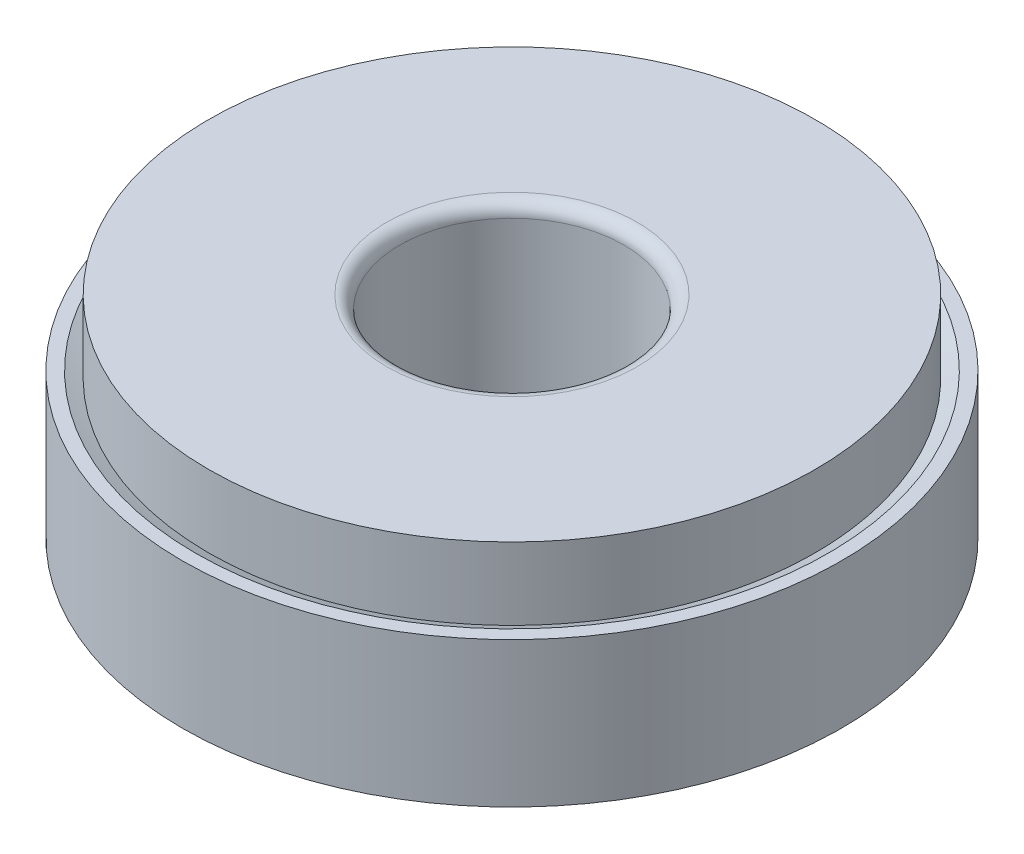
ISO-10303-21;
HEADER;
FILE_DESCRIPTION(('STEP AP214'),'2;1');
FILE_NAME('part.step','',(''),(''),'','','');
FILE_SCHEMA(('AUTOMOTIVE_DESIGN { 1 0 10303 214 1 1 1 1 }'));
ENDSEC;
DATA;
#1=APPLICATION_CONTEXT('core data for automotive mechanical design processes');
#2=APPLICATION_PROTOCOL_DEFINITION('international standard','automotive_design',2000,#1);
#3=PRODUCT_CONTEXT('',#1,'mechanical');
#4=PRODUCT('Part','Part','',(#3));
#5=PRODUCT_RELATED_PRODUCT_CATEGORY('part','',(#4));
#6=PRODUCT_DEFINITION_FORMATION('','',#4);
#7=PRODUCT_DEFINITION_CONTEXT('part definition',#1,'design');
#8=PRODUCT_DEFINITION('design','',#6,#7);
#9=PRODUCT_DEFINITION_SHAPE('','',#8);
#10=(LENGTH_UNIT() NAMED_UNIT(*) SI_UNIT(.MILLI.,.METRE.));
#11=(NAMED_UNIT(*) PLANE_ANGLE_UNIT() SI_UNIT($,.RADIAN.));
#12=(NAMED_UNIT(*) SI_UNIT($,.STERADIAN.) SOLID_ANGLE_UNIT());
#13=UNCERTAINTY_MEASURE_WITH_UNIT(LENGTH_MEASURE(1.E-05),#10,'distance_accuracy_value','');
#14=(GEOMETRIC_REPRESENTATION_CONTEXT(3) GLOBAL_UNCERTAINTY_ASSIGNED_CONTEXT((#13)) GLOBAL_UNIT_ASSIGNED_CONTEXT((#10,
#11,#12)) REPRESENTATION_CONTEXT('',''));
#15=CARTESIAN_POINT('',(0.,0.,0.));
#16=DIRECTION('',(0.,0.,1.));
#17=DIRECTION('',(1.,0.,0.));
#18=AXIS2_PLACEMENT_3D('',#15,#16,#17);
#19=CARTESIAN_POINT('',(0.,8.,0.));
#20=DIRECTION('',(0.,-1.,0.));
#21=DIRECTION('',(0.,0.,-1.));
#22=AXIS2_PLACEMENT_3D('',#19,#20,#21);
#23=CYLINDRICAL_SURFACE('',#22,11.5);
#24=CARTESIAN_POINT('',(0.,5.25424262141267,0.));
#25=DIRECTION('',(0.,1.,0.));
#26=DIRECTION('',(0.,0.,1.));
#27=AXIS2_PLACEMENT_3D('',#24,#25,#26);
#28=CIRCLE('',#27,11.5);
#29=CARTESIAN_POINT('',(0.,5.25424262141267,11.5));
#30=VERTEX_POINT('',#29);
#31=EDGE_CURVE('P0_E29',#30,#30,#28,.T.);
#32=ORIENTED_EDGE('',*,*,#31,.T.);
#33=EDGE_LOOP('',(#32));
#34=FACE_BOUND('',#33,.T.);
#35=CARTESIAN_POINT('',(0.,8.,0.));
#36=DIRECTION('',(0.,1.,0.));
#37=DIRECTION('',(0.,0.,1.));
#38=AXIS2_PLACEMENT_3D('',#35,#36,#37);
#39=CIRCLE('',#38,11.5);
#40=CARTESIAN_POINT('',(0.,8.,11.5));
#41=VERTEX_POINT('',#40);
#42=EDGE_CURVE('P0_E25',#41,#41,#39,.T.);
#43=ORIENTED_EDGE('',*,*,#42,.F.);
#44=EDGE_LOOP('',(#43));
#45=FACE_BOUND('',#44,.T.);
#46=ADVANCED_FACE('P0_F14',(#34,#45),#23,.T.);
#47=CARTESIAN_POINT('',(0.,8.,0.));
#48=DIRECTION('',(0.,1.,0.));
#49=DIRECTION('',(0.,0.,1.));
#50=AXIS2_PLACEMENT_3D('',#47,#48,#49);
#51=PLANE('',#50);
#52=CARTESIAN_POINT('',(0.,8.,0.));
#53=DIRECTION('',(0.,1.,0.));
#54=DIRECTION('',(0.,0.,1.));
#55=AXIS2_PLACEMENT_3D('',#52,#53,#54);
#56=CIRCLE('',#55,4.75);
#57=CARTESIAN_POINT('',(0.,8.,4.75));
#58=VERTEX_POINT('',#57);
#59=EDGE_CURVE('P0_E21',#58,#58,#56,.F.);
#60=ORIENTED_EDGE('',*,*,#59,.T.);
#61=EDGE_LOOP('',(#60));
#62=FACE_BOUND('',#61,.T.);
#63=ORIENTED_EDGE('',*,*,#42,.T.);
#64=EDGE_LOOP('',(#63));
#65=FACE_BOUND('',#64,.T.);
#66=ADVANCED_FACE('P0_F92',(#62,#65),#51,.T.);
#67=CARTESIAN_POINT('',(0.,29.2828124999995,0.));
#68=DIRECTION('',(-1.,0.,0.));
#69=DIRECTION('',(0.,-1.,0.));
#70=AXIS2_PLACEMENT_3D('',#67,#68,#69);
#71=SPHERICAL_SURFACE('',#70,26.6387343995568);
#72=CARTESIAN_POINT('',(0.,29.2828124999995,0.));
#73=DIRECTION('',(0.,1.,0.));
#74=DIRECTION('',(0.,0.,1.));
#75=AXIS2_PLACEMENT_3D('',#72,#73,#74);
#76=SPHERICAL_SURFACE('',#75,26.6387343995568);
#77=CARTESIAN_POINT('',(0.,3.3,0.));
#78=DIRECTION('',(0.,1.,0.));
#79=DIRECTION('',(0.,0.,1.));
#80=AXIS2_PLACEMENT_3D('',#77,#78,#79);
#81=CIRCLE('',#80,5.87499999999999);
#82=CARTESIAN_POINT('',(0.,3.3,5.87499999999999));
#83=VERTEX_POINT('',#82);
#84=EDGE_CURVE('P0_E49',#83,#83,#81,.T.);
#85=ORIENTED_EDGE('',*,*,#84,.T.);
#86=EDGE_LOOP('',(#85));
#87=FACE_BOUND('',#86,.T.);
#88=ORIENTED_EDGE('',*,*,#31,.F.);
#89=EDGE_LOOP('',(#88));
#90=FACE_BOUND('',#89,.T.);
#91=ADVANCED_FACE('P0_F53',(#87,#90),#76,.T.);
#92=CARTESIAN_POINT('',(0.,1.5,0.));
#93=DIRECTION('',(0.,1.,0.));
#94=DIRECTION('',(0.,0.,1.));
#95=AXIS2_PLACEMENT_3D('',#92,#93,#94);
#96=CYLINDRICAL_SURFACE('',#95,5.875);
#97=CARTESIAN_POINT('',(0.,2.4,0.));
#98=DIRECTION('',(0.,1.,0.));
#99=DIRECTION('',(0.,0.,1.));
#100=AXIS2_PLACEMENT_3D('',#97,#98,#99);
#101=CIRCLE('',#100,5.875);
#102=CARTESIAN_POINT('',(0.,2.4,5.875));
#103=VERTEX_POINT('',#102);
#104=EDGE_CURVE('P0_E40',#103,#103,#101,.T.);
#105=CARTESIAN_POINT('',(0.,1.5,0.));
#106=DIRECTION('',(0.,1.,0.));
#107=DIRECTION('',(0.,0.,1.));
#108=AXIS2_PLACEMENT_3D('',#105,#106,#107);
#109=CIRCLE('',#108,5.875);
#110=CARTESIAN_POINT('',(0.,1.5,5.875));
#111=VERTEX_POINT('',#110);
#112=EDGE_CURVE('P0_E33',#111,#111,#109,.T.);
#113=CARTESIAN_POINT('',(0.,2.4,5.875));
#114=CARTESIAN_POINT('',(0.,2.390625,5.875));
#115=CARTESIAN_POINT('',(0.,2.38125,5.875));
#116=CARTESIAN_POINT('',(0.,2.3625,5.875));
#117=CARTESIAN_POINT('',(0.,2.353125,5.875));
#118=CARTESIAN_POINT('',(0.,2.334375,5.875));
#119=CARTESIAN_POINT('',(0.,2.325,5.875));
#120=CARTESIAN_POINT('',(0.,2.30625,5.875));
#121=CARTESIAN_POINT('',(0.,2.296875,5.875));
#122=CARTESIAN_POINT('',(0.,2.278125,5.875));
#123=CARTESIAN_POINT('',(0.,2.26875,5.875));
#124=CARTESIAN_POINT('',(0.,2.25,5.875));
#125=CARTESIAN_POINT('',(0.,2.240625,5.875));
#126=CARTESIAN_POINT('',(0.,2.221875,5.875));
#127=CARTESIAN_POINT('',(0.,2.2125,5.875));
#128=CARTESIAN_POINT('',(0.,2.19375,5.875));
#129=CARTESIAN_POINT('',(0.,2.184375,5.875));
#130=CARTESIAN_POINT('',(0.,2.165625,5.875));
#131=CARTESIAN_POINT('',(0.,2.15625,5.875));
#132=CARTESIAN_POINT('',(0.,2.1375,5.875));
#133=CARTESIAN_POINT('',(0.,2.128125,5.875));
#134=CARTESIAN_POINT('',(0.,2.109375,5.875));
#135=CARTESIAN_POINT('',(0.,2.1,5.875));
#136=CARTESIAN_POINT('',(0.,2.08125,5.875));
#137=CARTESIAN_POINT('',(0.,2.071875,5.875));
#138=CARTESIAN_POINT('',(0.,2.053125,5.875));
#139=CARTESIAN_POINT('',(0.,2.04375,5.875));
#140=CARTESIAN_POINT('',(0.,2.025,5.875));
#141=CARTESIAN_POINT('',(0.,2.015625,5.875));
#142=CARTESIAN_POINT('',(0.,1.996875,5.875));
#143=CARTESIAN_POINT('',(0.,1.9875,5.875));
#144=CARTESIAN_POINT('',(0.,1.96875,5.875));
#145=CARTESIAN_POINT('',(0.,1.959375,5.875));
#146=CARTESIAN_POINT('',(0.,1.940625,5.875));
#147=CARTESIAN_POINT('',(0.,1.93125,5.875));
#148=CARTESIAN_POINT('',(0.,1.9125,5.875));
#149=CARTESIAN_POINT('',(0.,1.903125,5.875));
#150=CARTESIAN_POINT('',(0.,1.884375,5.875));
#151=CARTESIAN_POINT('',(0.,1.875,5.875));
#152=CARTESIAN_POINT('',(0.,1.85625,5.875));
#153=CARTESIAN_POINT('',(0.,1.846875,5.875));
#154=CARTESIAN_POINT('',(0.,1.828125,5.875));
#155=CARTESIAN_POINT('',(0.,1.81875,5.875));
#156=CARTESIAN_POINT('',(0.,1.8,5.875));
#157=CARTESIAN_POINT('',(0.,1.790625,5.875));
#158=CARTESIAN_POINT('',(0.,1.771875,5.875));
#159=CARTESIAN_POINT('',(0.,1.7625,5.875));
#160=CARTESIAN_POINT('',(0.,1.74375,5.875));
#161=CARTESIAN_POINT('',(0.,1.734375,5.875));
#162=CARTESIAN_POINT('',(0.,1.715625,5.875));
#163=CARTESIAN_POINT('',(0.,1.70625,5.875));
#164=CARTESIAN_POINT('',(0.,1.6875,5.875));
#165=CARTESIAN_POINT('',(0.,1.678125,5.875));
#166=CARTESIAN_POINT('',(0.,1.659375,5.875));
#167=CARTESIAN_POINT('',(0.,1.65,5.875));
#168=CARTESIAN_POINT('',(0.,1.63125,5.875));
#169=CARTESIAN_POINT('',(0.,1.621875,5.875));
#170=CARTESIAN_POINT('',(0.,1.603125,5.875));
#171=CARTESIAN_POINT('',(0.,1.59375,5.875));
#172=CARTESIAN_POINT('',(0.,1.575,5.875));
#173=CARTESIAN_POINT('',(0.,1.565625,5.875));
#174=CARTESIAN_POINT('',(0.,1.546875,5.875));
#175=CARTESIAN_POINT('',(0.,1.5375,5.875));
#176=CARTESIAN_POINT('',(0.,1.51875,5.875));
#177=CARTESIAN_POINT('',(0.,1.509375,5.875));
#178=CARTESIAN_POINT('',(0.,1.5,5.875));
#179=B_SPLINE_CURVE_WITH_KNOTS('',3,(#113,#114,#115,#116,#117,#118,#119,#120,#121,#122,#123,
#124,#125,#126,#127,#128,#129,#130,#131,#132,#133,#134,#135,#136,#137,#138,#139,#140,#141,#142,
#143,#144,#145,#146,#147,#148,#149,#150,#151,#152,#153,#154,#155,#156,#157,#158,#159,#160,#161,
#162,#163,#164,#165,#166,#167,#168,#169,#170,#171,#172,#173,#174,#175,#176,#177,#178),
.UNSPECIFIED.,.F.,.F.,(4,2,2,2,2,2,2,2,2,2,2,2,2,2,2,2,2,2,2,2,2,2,2,2,2,2,2,2,2,2,2,2,4),(0.,
0.0281249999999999,0.0562499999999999,0.0843749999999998,0.1125,0.140625,0.16875,0.196875,0.225,
0.253124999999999,0.281249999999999,0.309374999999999,0.337499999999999,0.365624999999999,
0.393749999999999,0.421874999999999,0.449999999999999,0.478124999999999,0.506249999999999,
0.534374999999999,0.562499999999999,0.590624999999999,0.618749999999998,0.646874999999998,
0.674999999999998,0.703124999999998,0.731249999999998,0.759374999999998,0.787499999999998,
0.815624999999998,0.843749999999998,0.871874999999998,0.899999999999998),.UNSPECIFIED.);
#180=EDGE_CURVE('P0_BSEAM75',#103,#111,#179,.T.);
#181=ORIENTED_EDGE('',*,*,#104,.F.);
#182=ORIENTED_EDGE('',*,*,#112,.T.);
#183=ORIENTED_EDGE('',*,*,#180,.T.);
#184=ORIENTED_EDGE('',*,*,#180,.F.);
#185=EDGE_LOOP('',(#181,#183,#182,#184));
#186=FACE_BOUND('',#185,.T.);
#187=ADVANCED_FACE('P0_F75',(#186),#96,.T.);
#188=CARTESIAN_POINT('',(0.,1.5,0.));
#189=DIRECTION('',(0.,1.,0.));
#190=DIRECTION('',(0.,0.,1.));
#191=AXIS2_PLACEMENT_3D('',#188,#189,#190);
#192=PLANE('',#191);
#193=CARTESIAN_POINT('',(0.,1.5,0.));
#194=DIRECTION('',(0.,-1.,0.));
#195=DIRECTION('',(0.,0.,-1.));
#196=AXIS2_PLACEMENT_3D('',#193,#194,#195);
#197=CIRCLE('',#196,4.25);
#198=CARTESIAN_POINT('',(0.,1.5,-4.25));
#199=VERTEX_POINT('',#198);
#200=EDGE_CURVE('P0_E37',#199,#199,#197,.T.);
#201=ORIENTED_EDGE('',*,*,#200,.F.);
#202=EDGE_LOOP('',(#201));
#203=FACE_BOUND('',#202,.T.);
#204=ORIENTED_EDGE('',*,*,#112,.F.);
#205=EDGE_LOOP('',(#204));
#206=FACE_BOUND('',#205,.T.);
#207=ADVANCED_FACE('P0_F78',(#203,#206),#192,.F.);
#208=CARTESIAN_POINT('',(0.,8.,0.));
#209=DIRECTION('',(0.,-1.,0.));
#210=DIRECTION('',(0.,0.,-1.));
#211=AXIS2_PLACEMENT_3D('',#208,#209,#210);
#212=CYLINDRICAL_SURFACE('',#211,4.25);
#213=CARTESIAN_POINT('',(0.,7.5,0.));
#214=DIRECTION('',(0.,1.,0.));
#215=DIRECTION('',(0.,0.,1.));
#216=AXIS2_PLACEMENT_3D('',#213,#214,#215);
#217=CIRCLE('',#216,4.25);
#218=CARTESIAN_POINT('',(0.,7.5,-4.25));
#219=VERTEX_POINT('',#218);
#220=EDGE_CURVE('P0_E10',#219,#219,#217,.T.);
#221=CARTESIAN_POINT('',(0.,7.5,-4.25));
#222=CARTESIAN_POINT('',(0.,7.4375,-4.25));
#223=CARTESIAN_POINT('',(0.,7.375,-4.25));
#224=CARTESIAN_POINT('',(0.,7.25,-4.25));
#225=CARTESIAN_POINT('',(0.,7.1875,-4.25));
#226=CARTESIAN_POINT('',(0.,7.0625,-4.25));
#227=CARTESIAN_POINT('',(0.,7.,-4.25));
#228=CARTESIAN_POINT('',(0.,6.875,-4.25));
#229=CARTESIAN_POINT('',(0.,6.8125,-4.25));
#230=CARTESIAN_POINT('',(0.,6.6875,-4.25));
#231=CARTESIAN_POINT('',(0.,6.625,-4.25));
#232=CARTESIAN_POINT('',(0.,6.5,-4.25));
#233=CARTESIAN_POINT('',(0.,6.4375,-4.25));
#234=CARTESIAN_POINT('',(0.,6.3125,-4.25));
#235=CARTESIAN_POINT('',(0.,6.25,-4.25));
#236=CARTESIAN_POINT('',(0.,6.125,-4.25));
#237=CARTESIAN_POINT('',(0.,6.0625,-4.25));
#238=CARTESIAN_POINT('',(0.,5.9375,-4.25));
#239=CARTESIAN_POINT('',(0.,5.875,-4.25));
#240=CARTESIAN_POINT('',(0.,5.75,-4.25));
#241=CARTESIAN_POINT('',(0.,5.6875,-4.25));
#242=CARTESIAN_POINT('',(0.,5.5625,-4.25));
#243=CARTESIAN_POINT('',(0.,5.5,-4.25));
#244=CARTESIAN_POINT('',(0.,5.375,-4.25));
#245=CARTESIAN_POINT('',(0.,5.3125,-4.25));
#246=CARTESIAN_POINT('',(0.,5.1875,-4.25));
#247=CARTESIAN_POINT('',(0.,5.125,-4.25));
#248=CARTESIAN_POINT('',(0.,5.,-4.25));
#249=CARTESIAN_POINT('',(0.,4.9375,-4.25));
#250=CARTESIAN_POINT('',(0.,4.8125,-4.25));
#251=CARTESIAN_POINT('',(0.,4.75,-4.25));
#252=CARTESIAN_POINT('',(0.,4.625,-4.25));
#253=CARTESIAN_POINT('',(0.,4.5625,-4.25));
#254=CARTESIAN_POINT('',(0.,4.4375,-4.25));
#255=CARTESIAN_POINT('',(0.,4.375,-4.25));
#256=CARTESIAN_POINT('',(0.,4.25,-4.25));
#257=CARTESIAN_POINT('',(0.,4.1875,-4.25));
#258=CARTESIAN_POINT('',(0.,4.0625,-4.25));
#259=CARTESIAN_POINT('',(0.,4.,-4.25));
#260=CARTESIAN_POINT('',(0.,3.875,-4.25));
#261=CARTESIAN_POINT('',(0.,3.8125,-4.25));
#262=CARTESIAN_POINT('',(0.,3.6875,-4.25));
#263=CARTESIAN_POINT('',(0.,3.625,-4.25));
#264=CARTESIAN_POINT('',(0.,3.5,-4.25));
#265=CARTESIAN_POINT('',(0.,3.4375,-4.25));
#266=CARTESIAN_POINT('',(0.,3.3125,-4.25));
#267=CARTESIAN_POINT('',(0.,3.25,-4.25));
#268=CARTESIAN_POINT('',(0.,3.125,-4.25));
#269=CARTESIAN_POINT('',(0.,3.0625,-4.25));
#270=CARTESIAN_POINT('',(0.,2.9375,-4.25));
#271=CARTESIAN_POINT('',(0.,2.875,-4.25));
#272=CARTESIAN_POINT('',(0.,2.75,-4.25));
#273=CARTESIAN_POINT('',(0.,2.6875,-4.25));
#274=CARTESIAN_POINT('',(0.,2.5625,-4.25));
#275=CARTESIAN_POINT('',(0.,2.5,-4.25));
#276=CARTESIAN_POINT('',(0.,2.375,-4.25));
#277=CARTESIAN_POINT('',(0.,2.3125,-4.25));
#278=CARTESIAN_POINT('',(0.,2.1875,-4.25));
#279=CARTESIAN_POINT('',(0.,2.125,-4.25));
#280=CARTESIAN_POINT('',(0.,2.,-4.25));
#281=CARTESIAN_POINT('',(0.,1.9375,-4.25));
#282=CARTESIAN_POINT('',(0.,1.8125,-4.25));
#283=CARTESIAN_POINT('',(0.,1.75,-4.25));
#284=CARTESIAN_POINT('',(0.,1.625,-4.25));
#285=CARTESIAN_POINT('',(0.,1.5625,-4.25));
#286=CARTESIAN_POINT('',(0.,1.5,-4.25));
#287=B_SPLINE_CURVE_WITH_KNOTS('',3,(#221,#222,#223,#224,#225,#226,#227,#228,#229,#230,#231,
#232,#233,#234,#235,#236,#237,#238,#239,#240,#241,#242,#243,#244,#245,#246,#247,#248,#249,#250,
#251,#252,#253,#254,#255,#256,#257,#258,#259,#260,#261,#262,#263,#264,#265,#266,#267,#268,#269,
#270,#271,#272,#273,#274,#275,#276,#277,#278,#279,#280,#281,#282,#283,#284,#285,#286),
.UNSPECIFIED.,.F.,.F.,(4,2,2,2,2,2,2,2,2,2,2,2,2,2,2,2,2,2,2,2,2,2,2,2,2,2,2,2,2,2,2,2,4),(0.,
0.187499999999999,0.374999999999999,0.5625,0.75,0.937499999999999,1.125,1.3125,1.5,1.6875,1.875,
2.0625,2.25,2.4375,2.625,2.8125,3.,3.1875,3.375,3.5625,3.75,3.9375,4.125,4.3125,4.5,4.6875,
4.875,5.0625,5.25,5.4375,5.625,5.8125,6.),.UNSPECIFIED.);
#288=EDGE_CURVE('P0_BSEAM71',#219,#199,#287,.T.);
#289=ORIENTED_EDGE('',*,*,#220,.T.);
#290=ORIENTED_EDGE('',*,*,#200,.T.);
#291=ORIENTED_EDGE('',*,*,#288,.T.);
#292=ORIENTED_EDGE('',*,*,#288,.F.);
#293=EDGE_LOOP('',(#289,#291,#290,#292));
#294=FACE_BOUND('',#293,.T.);
#295=ADVANCED_FACE('P0_F71',(#294),#212,.F.);
#296=CARTESIAN_POINT('',(-5.875,2.4,0.));
#297=DIRECTION('',(0.,-1.,0.));
#298=DIRECTION('',(0.,0.,-1.));
#299=AXIS2_PLACEMENT_3D('',#296,#297,#298);
#300=PLANE('',#299);
#301=CARTESIAN_POINT('',(0.,2.4,0.));
#302=DIRECTION('',(0.,1.,0.));
#303=DIRECTION('',(0.,0.,1.));
#304=AXIS2_PLACEMENT_3D('',#301,#302,#303);
#305=CIRCLE('',#304,5.0625);
#306=CARTESIAN_POINT('',(0.,2.4,5.0625));
#307=VERTEX_POINT('',#306);
#308=EDGE_CURVE('P0_E43',#307,#307,#305,.T.);
#309=ORIENTED_EDGE('',*,*,#308,.F.);
#310=EDGE_LOOP('',(#309));
#311=FACE_BOUND('',#310,.T.);
#312=ORIENTED_EDGE('',*,*,#104,.T.);
#313=EDGE_LOOP('',(#312));
#314=FACE_BOUND('',#313,.T.);
#315=ADVANCED_FACE('P0_F65',(#311,#314),#300,.F.);
#316=CARTESIAN_POINT('',(0.,8.,0.));
#317=DIRECTION('',(0.,1.,0.));
#318=DIRECTION('',(0.,0.,1.));
#319=AXIS2_PLACEMENT_3D('',#316,#317,#318);
#320=CYLINDRICAL_SURFACE('',#319,5.0625);
#321=CARTESIAN_POINT('',(0.,3.3,0.));
#322=DIRECTION('',(0.,1.,0.));
#323=DIRECTION('',(0.,0.,1.));
#324=AXIS2_PLACEMENT_3D('',#321,#322,#323);
#325=CIRCLE('',#324,5.0625);
#326=CARTESIAN_POINT('',(0.,3.3,5.0625));
#327=VERTEX_POINT('',#326);
#328=EDGE_CURVE('P0_E46',#327,#327,#325,.T.);
#329=ORIENTED_EDGE('',*,*,#328,.F.);
#330=EDGE_LOOP('',(#329));
#331=FACE_BOUND('',#330,.T.);
#332=ORIENTED_EDGE('',*,*,#308,.T.);
#333=EDGE_LOOP('',(#332));
#334=FACE_BOUND('',#333,.T.);
#335=ADVANCED_FACE('P0_F59',(#331,#334),#320,.T.);
#336=CARTESIAN_POINT('',(-5.87499999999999,3.3,0.));
#337=DIRECTION('',(0.,1.,0.));
#338=DIRECTION('',(0.,0.,1.));
#339=AXIS2_PLACEMENT_3D('',#336,#337,#338);
#340=PLANE('',#339);
#341=ORIENTED_EDGE('',*,*,#84,.F.);
#342=EDGE_LOOP('',(#341));
#343=FACE_BOUND('',#342,.T.);
#344=ORIENTED_EDGE('',*,*,#328,.T.);
#345=EDGE_LOOP('',(#344));
#346=FACE_BOUND('',#345,.T.);
#347=ADVANCED_FACE('P0_F56',(#343,#346),#340,.F.);
#348=CARTESIAN_POINT('',(0.,7.5,0.));
#349=DIRECTION('',(0.,1.,0.));
#350=DIRECTION('',(0.,0.,1.));
#351=AXIS2_PLACEMENT_3D('',#348,#349,#350);
#352=TOROIDAL_SURFACE('',#351,4.75,0.5);
#353=ORIENTED_EDGE('',*,*,#220,.F.);
#354=EDGE_LOOP('',(#353));
#355=FACE_BOUND('',#354,.T.);
#356=ORIENTED_EDGE('',*,*,#59,.F.);
#357=EDGE_LOOP('',(#356));
#358=FACE_BOUND('',#357,.T.);
#359=ADVANCED_FACE('P0_F16',(#355,#358),#352,.T.);
#360=CLOSED_SHELL('',(#46,#66,#91,#187,#207,#295,#315,#335,#347,#359));
#361=MANIFOLD_SOLID_BREP('P0_B1',#360);
#362=CARTESIAN_POINT('',(0.,5.5,0.));
#363=DIRECTION('',(0.,-1.,0.));
#364=DIRECTION('',(0.,0.,-1.));
#365=AXIS2_PLACEMENT_3D('',#362,#363,#364);
#366=CYLINDRICAL_SURFACE('',#365,12.5);
#367=CARTESIAN_POINT('',(0.,5.5,0.));
#368=DIRECTION('',(0.,1.,0.));
#369=DIRECTION('',(0.,0.,1.));
#370=AXIS2_PLACEMENT_3D('',#367,#368,#369);
#371=CIRCLE('',#370,12.5);
#372=CARTESIAN_POINT('',(0.,5.5,12.5));
#373=VERTEX_POINT('',#372);
#374=EDGE_CURVE('P1_E9',#373,#373,#371,.T.);
#375=ORIENTED_EDGE('',*,*,#374,.F.);
#376=EDGE_LOOP('',(#375));
#377=FACE_BOUND('',#376,.T.);
#378=CARTESIAN_POINT('',(0.,0.,0.));
#379=DIRECTION('',(0.,1.,0.));
#380=DIRECTION('',(0.,0.,1.));
#381=AXIS2_PLACEMENT_3D('',#378,#379,#380);
#382=CIRCLE('',#381,12.5);
#383=CARTESIAN_POINT('',(0.,0.,12.5));
#384=VERTEX_POINT('',#383);
#385=EDGE_CURVE('P1_E20',#384,#384,#382,.T.);
#386=ORIENTED_EDGE('',*,*,#385,.T.);
#387=EDGE_LOOP('',(#386));
#388=FACE_BOUND('',#387,.T.);
#389=ADVANCED_FACE('P1_F13',(#377,#388),#366,.T.);
#390=CARTESIAN_POINT('',(0.,5.5,0.));
#391=DIRECTION('',(0.,1.,0.));
#392=DIRECTION('',(0.,0.,1.));
#393=AXIS2_PLACEMENT_3D('',#390,#391,#392);
#394=PLANE('',#393);
#395=CARTESIAN_POINT('',(0.,5.5,0.));
#396=DIRECTION('',(0.,1.,0.));
#397=DIRECTION('',(0.,0.,1.));
#398=AXIS2_PLACEMENT_3D('',#395,#396,#397);
#399=CIRCLE('',#398,12.);
#400=CARTESIAN_POINT('',(0.,5.5,12.));
#401=VERTEX_POINT('',#400);
#402=EDGE_CURVE('P1_E35',#401,#401,#399,.T.);
#403=ORIENTED_EDGE('',*,*,#402,.F.);
#404=EDGE_LOOP('',(#403));
#405=FACE_BOUND('',#404,.T.);
#406=ORIENTED_EDGE('',*,*,#374,.T.);
#407=EDGE_LOOP('',(#406));
#408=FACE_BOUND('',#407,.T.);
#409=ADVANCED_FACE('P1_F55',(#405,#408),#394,.T.);
#410=CARTESIAN_POINT('',(0.,0.,0.));
#411=DIRECTION('',(0.,1.,0.));
#412=DIRECTION('',(0.,0.,1.));
#413=AXIS2_PLACEMENT_3D('',#410,#411,#412);
#414=PLANE('',#413);
#415=CARTESIAN_POINT('',(0.,0.,0.));
#416=DIRECTION('',(0.,-1.,0.));
#417=DIRECTION('',(0.,0.,-1.));
#418=AXIS2_PLACEMENT_3D('',#415,#416,#417);
#419=CIRCLE('',#418,7.5);
#420=CARTESIAN_POINT('',(0.,0.,-7.5));
#421=VERTEX_POINT('',#420);
#422=EDGE_CURVE('P1_E27',#421,#421,#419,.T.);
#423=ORIENTED_EDGE('',*,*,#422,.F.);
#424=EDGE_LOOP('',(#423));
#425=FACE_BOUND('',#424,.T.);
#426=ORIENTED_EDGE('',*,*,#385,.F.);
#427=EDGE_LOOP('',(#426));
#428=FACE_BOUND('',#427,.T.);
#429=ADVANCED_FACE('P1_F60',(#425,#428),#414,.F.);
#430=CARTESIAN_POINT('',(0.,2.75,0.));
#431=DIRECTION('',(0.,-1.,0.));
#432=DIRECTION('',(0.,0.,-1.));
#433=AXIS2_PLACEMENT_3D('',#430,#431,#432);
#434=CYLINDRICAL_SURFACE('',#433,7.5);
#435=CARTESIAN_POINT('',(0.,2.75,0.));
#436=DIRECTION('',(0.,-1.,0.));
#437=DIRECTION('',(0.,0.,-1.));
#438=AXIS2_PLACEMENT_3D('',#435,#436,#437);
#439=CIRCLE('',#438,7.5);
#440=CARTESIAN_POINT('',(0.,2.75,-7.5));
#441=VERTEX_POINT('',#440);
#442=EDGE_CURVE('P1_E25',#441,#441,#439,.T.);
#443=ORIENTED_EDGE('',*,*,#442,.F.);
#444=EDGE_LOOP('',(#443));
#445=FACE_BOUND('',#444,.T.);
#446=ORIENTED_EDGE('',*,*,#422,.T.);
#447=EDGE_LOOP('',(#446));
#448=FACE_BOUND('',#447,.T.);
#449=ADVANCED_FACE('P1_F67',(#445,#448),#434,.F.);
#450=CARTESIAN_POINT('',(0.,2.75,0.));
#451=DIRECTION('',(0.,-1.,0.));
#452=DIRECTION('',(0.,0.,-1.));
#453=AXIS2_PLACEMENT_3D('',#450,#451,#452);
#454=PLANE('',#453);
#455=CARTESIAN_POINT('',(0.,2.75,0.));
#456=DIRECTION('',(0.,-1.,0.));
#457=DIRECTION('',(0.,0.,-1.));
#458=AXIS2_PLACEMENT_3D('',#455,#456,#457);
#459=CIRCLE('',#458,5.875);
#460=CARTESIAN_POINT('',(0.,2.75,-5.875));
#461=VERTEX_POINT('',#460);
#462=EDGE_CURVE('P1_E30',#461,#461,#459,.T.);
#463=ORIENTED_EDGE('',*,*,#462,.F.);
#464=EDGE_LOOP('',(#463));
#465=FACE_BOUND('',#464,.T.);
#466=ORIENTED_EDGE('',*,*,#442,.T.);
#467=EDGE_LOOP('',(#466));
#468=FACE_BOUND('',#467,.T.);
#469=ADVANCED_FACE('P1_F52',(#465,#468),#454,.T.);
#470=CARTESIAN_POINT('',(0.,5.5,0.));
#471=DIRECTION('',(0.,-1.,0.));
#472=DIRECTION('',(0.,0.,-1.));
#473=AXIS2_PLACEMENT_3D('',#470,#471,#472);
#474=CYLINDRICAL_SURFACE('',#473,5.875);
#475=CARTESIAN_POINT('',(0.,3.3,0.));
#476=DIRECTION('',(0.,1.,0.));
#477=DIRECTION('',(0.,0.,1.));
#478=AXIS2_PLACEMENT_3D('',#475,#476,#477);
#479=CIRCLE('',#478,5.875);
#480=CARTESIAN_POINT('',(0.,3.3,5.875));
#481=VERTEX_POINT('',#480);
#482=EDGE_CURVE('P1_E16',#481,#481,#479,.T.);
#483=ORIENTED_EDGE('',*,*,#482,.T.);
#484=EDGE_LOOP('',(#483));
#485=FACE_BOUND('',#484,.T.);
#486=ORIENTED_EDGE('',*,*,#462,.T.);
#487=EDGE_LOOP('',(#486));
#488=FACE_BOUND('',#487,.T.);
#489=ADVANCED_FACE('P1_F42',(#485,#488),#474,.F.);
#490=CARTESIAN_POINT('',(0.,29.2828125,0.));
#491=DIRECTION('',(-1.,0.,0.));
#492=DIRECTION('',(0.,1.,0.));
#493=AXIS2_PLACEMENT_3D('',#490,#491,#492);
#494=SPHERICAL_SURFACE('',#493,26.6387343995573);
#495=CARTESIAN_POINT('',(0.,29.2828125,0.));
#496=DIRECTION('',(0.,1.,0.));
#497=DIRECTION('',(0.,0.,1.));
#498=AXIS2_PLACEMENT_3D('',#495,#496,#497);
#499=SPHERICAL_SURFACE('',#498,26.6387343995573);
#500=ORIENTED_EDGE('',*,*,#402,.T.);
#501=EDGE_LOOP('',(#500));
#502=FACE_BOUND('',#501,.T.);
#503=ORIENTED_EDGE('',*,*,#482,.F.);
#504=EDGE_LOOP('',(#503));
#505=FACE_BOUND('',#504,.T.);
#506=ADVANCED_FACE('P1_F45',(#502,#505),#499,.F.);
#507=CLOSED_SHELL('',(#389,#409,#429,#449,#469,#489,#506));
#508=MANIFOLD_SOLID_BREP('P1_B1',#507);
#509=ADVANCED_BREP_SHAPE_REPRESENTATION('',(#18,#361,#508),#14);
#510=SHAPE_DEFINITION_REPRESENTATION(#9,#509);
ENDSEC;
END-ISO-10303-21;
